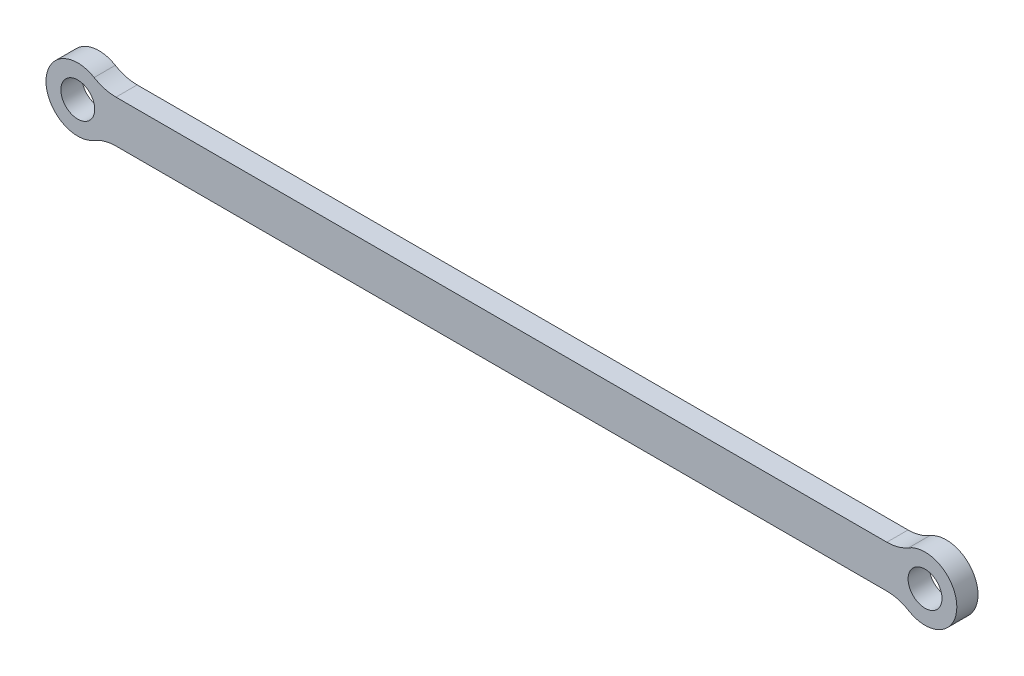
ISO-10303-21;
HEADER;
FILE_DESCRIPTION(('STEP AP214'),'2;1');
FILE_NAME('part.step','',(''),(''),'','','');
FILE_SCHEMA(('AUTOMOTIVE_DESIGN { 1 0 10303 214 1 1 1 1 }'));
ENDSEC;
DATA;
#1=APPLICATION_CONTEXT('core data for automotive mechanical design processes');
#2=APPLICATION_PROTOCOL_DEFINITION('international standard','automotive_design',2000,#1);
#3=PRODUCT_CONTEXT('',#1,'mechanical');
#4=PRODUCT('Part','Part','',(#3));
#5=PRODUCT_RELATED_PRODUCT_CATEGORY('part','',(#4));
#6=PRODUCT_DEFINITION_FORMATION('','',#4);
#7=PRODUCT_DEFINITION_CONTEXT('part definition',#1,'design');
#8=PRODUCT_DEFINITION('design','',#6,#7);
#9=PRODUCT_DEFINITION_SHAPE('','',#8);
#10=(LENGTH_UNIT() NAMED_UNIT(*) SI_UNIT(.MILLI.,.METRE.));
#11=(NAMED_UNIT(*) PLANE_ANGLE_UNIT() SI_UNIT($,.RADIAN.));
#12=(NAMED_UNIT(*) SI_UNIT($,.STERADIAN.) SOLID_ANGLE_UNIT());
#13=UNCERTAINTY_MEASURE_WITH_UNIT(LENGTH_MEASURE(1.E-05),#10,'distance_accuracy_value','');
#14=(GEOMETRIC_REPRESENTATION_CONTEXT(3) GLOBAL_UNCERTAINTY_ASSIGNED_CONTEXT((#13)) GLOBAL_UNIT_ASSIGNED_CONTEXT((#10,
#11,#12)) REPRESENTATION_CONTEXT('',''));
#15=CARTESIAN_POINT('',(0.,0.,0.));
#16=DIRECTION('',(0.,0.,1.));
#17=DIRECTION('',(1.,0.,0.));
#18=AXIS2_PLACEMENT_3D('',#15,#16,#17);
#19=CARTESIAN_POINT('',(-83.1438532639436,357.100052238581,5.));
#20=DIRECTION('',(0.,0.,1.));
#21=DIRECTION('',(1.,0.,0.));
#22=AXIS2_PLACEMENT_3D('',#19,#20,#21);
#23=PLANE('',#22);
#24=CARTESIAN_POINT('',(107.842268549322,342.100052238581,5.));
#25=DIRECTION('',(0.,0.,1.));
#26=DIRECTION('',(1.,0.,0.));
#27=AXIS2_PLACEMENT_3D('',#24,#25,#26);
#28=CIRCLE('',#27,4.00000000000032);
#29=CARTESIAN_POINT('',(111.842268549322,342.100052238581,5.));
#30=VERTEX_POINT('',#29);
#31=EDGE_CURVE('E138',#30,#30,#28,.T.);
#32=ORIENTED_EDGE('',*,*,#31,.F.);
#33=EDGE_LOOP('',(#32));
#34=FACE_BOUND('',#33,.T.);
#35=CARTESIAN_POINT('',(-83.1438532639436,357.100052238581,5.));
#36=DIRECTION('',(0.,0.,-1.));
#37=DIRECTION('',(1.,0.,0.));
#38=AXIS2_PLACEMENT_3D('',#35,#36,#37);
#39=CIRCLE('',#38,10.);
#40=CARTESIAN_POINT('',(-83.1438532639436,347.100052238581,5.));
#41=VERTEX_POINT('',#40);
#42=CARTESIAN_POINT('',(-88.2946408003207,348.528623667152,5.));
#43=VERTEX_POINT('',#42);
#44=EDGE_CURVE('E149',#41,#43,#39,.T.);
#45=ORIENTED_EDGE('',*,*,#44,.T.);
#46=CARTESIAN_POINT('',(-92.1577314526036,342.100052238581,5.));
#47=DIRECTION('',(0.,0.,1.));
#48=DIRECTION('',(1.,0.,0.));
#49=AXIS2_PLACEMENT_3D('',#46,#47,#48);
#50=CIRCLE('',#49,7.50000000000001);
#51=CARTESIAN_POINT('',(-88.2946408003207,335.67148081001,5.));
#52=VERTEX_POINT('',#51);
#53=EDGE_CURVE('E97',#43,#52,#50,.T.);
#54=ORIENTED_EDGE('',*,*,#53,.T.);
#55=CARTESIAN_POINT('',(-83.1438532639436,327.100052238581,5.));
#56=DIRECTION('',(0.,0.,-1.));
#57=DIRECTION('',(-1.,0.,0.));
#58=AXIS2_PLACEMENT_3D('',#55,#56,#57);
#59=CIRCLE('',#58,10.);
#60=CARTESIAN_POINT('',(-83.1438532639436,337.100052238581,5.));
#61=VERTEX_POINT('',#60);
#62=EDGE_CURVE('E164',#52,#61,#59,.T.);
#63=ORIENTED_EDGE('',*,*,#62,.T.);
#64=DIRECTION('',(1.,0.,0.));
#65=VECTOR('',#64,1.);
#66=CARTESIAN_POINT('',(-83.1438532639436,337.100052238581,5.));
#67=LINE('',#66,#65);
#68=CARTESIAN_POINT('',(98.8283903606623,337.100052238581,5.));
#69=VERTEX_POINT('',#68);
#70=EDGE_CURVE('E177',#61,#69,#67,.T.);
#71=ORIENTED_EDGE('',*,*,#70,.T.);
#72=CARTESIAN_POINT('',(98.8283903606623,327.100052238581,5.));
#73=DIRECTION('',(0.,0.,-1.));
#74=DIRECTION('',(-1.,0.,0.));
#75=AXIS2_PLACEMENT_3D('',#72,#73,#74);
#76=CIRCLE('',#75,10.);
#77=CARTESIAN_POINT('',(103.97917789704,335.67148081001,5.));
#78=VERTEX_POINT('',#77);
#79=EDGE_CURVE('E116',#69,#78,#76,.T.);
#80=ORIENTED_EDGE('',*,*,#79,.T.);
#81=CARTESIAN_POINT('',(107.842268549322,342.100052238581,5.));
#82=DIRECTION('',(0.,0.,1.));
#83=DIRECTION('',(1.,0.,0.));
#84=AXIS2_PLACEMENT_3D('',#81,#82,#83);
#85=CIRCLE('',#84,7.49999999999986);
#86=CARTESIAN_POINT('',(103.97917789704,348.528623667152,5.));
#87=VERTEX_POINT('',#86);
#88=EDGE_CURVE('E110',#78,#87,#85,.T.);
#89=ORIENTED_EDGE('',*,*,#88,.T.);
#90=CARTESIAN_POINT('',(98.8283903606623,357.100052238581,5.));
#91=DIRECTION('',(0.,0.,-1.));
#92=DIRECTION('',(1.,0.,0.));
#93=AXIS2_PLACEMENT_3D('',#90,#91,#92);
#94=CIRCLE('',#93,10.);
#95=CARTESIAN_POINT('',(98.8283903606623,347.100052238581,5.));
#96=VERTEX_POINT('',#95);
#97=EDGE_CURVE('E114',#87,#96,#94,.T.);
#98=ORIENTED_EDGE('',*,*,#97,.T.);
#99=DIRECTION('',(-1.,0.,0.));
#100=VECTOR('',#99,1.);
#101=CARTESIAN_POINT('',(-83.1438532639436,347.100052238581,5.));
#102=LINE('',#101,#100);
#103=EDGE_CURVE('E54',#96,#41,#102,.T.);
#104=ORIENTED_EDGE('',*,*,#103,.T.);
#105=EDGE_LOOP('',(#45,#54,#63,#71,#80,#89,#98,#104));
#106=FACE_BOUND('',#105,.T.);
#107=CARTESIAN_POINT('',(-92.1577314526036,342.100052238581,5.));
#108=DIRECTION('',(0.,0.,1.));
#109=DIRECTION('',(1.,0.,0.));
#110=AXIS2_PLACEMENT_3D('',#107,#108,#109);
#111=CIRCLE('',#110,4.00000000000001);
#112=CARTESIAN_POINT('',(-88.1577314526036,342.100052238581,5.));
#113=VERTEX_POINT('',#112);
#114=EDGE_CURVE('E186',#113,#113,#111,.T.);
#115=ORIENTED_EDGE('',*,*,#114,.F.);
#116=EDGE_LOOP('',(#115));
#117=FACE_BOUND('',#116,.T.);
#118=ADVANCED_FACE('F37',(#34,#106,#117),#23,.T.);
#119=CARTESIAN_POINT('',(-83.1438532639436,357.100052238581,0.));
#120=DIRECTION('',(0.,0.,1.));
#121=DIRECTION('',(1.,0.,0.));
#122=AXIS2_PLACEMENT_3D('',#119,#120,#121);
#123=PLANE('',#122);
#124=CARTESIAN_POINT('',(-83.1438532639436,357.100052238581,0.));
#125=DIRECTION('',(0.,0.,-1.));
#126=DIRECTION('',(1.,0.,0.));
#127=AXIS2_PLACEMENT_3D('',#124,#125,#126);
#128=CIRCLE('',#127,10.);
#129=CARTESIAN_POINT('',(-83.1438532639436,347.100052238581,0.));
#130=VERTEX_POINT('',#129);
#131=CARTESIAN_POINT('',(-88.2946408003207,348.528623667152,0.));
#132=VERTEX_POINT('',#131);
#133=EDGE_CURVE('E134',#130,#132,#128,.T.);
#134=ORIENTED_EDGE('',*,*,#133,.F.);
#135=DIRECTION('',(-1.,0.,0.));
#136=VECTOR('',#135,1.);
#137=CARTESIAN_POINT('',(-83.1438532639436,347.100052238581,0.));
#138=LINE('',#137,#136);
#139=CARTESIAN_POINT('',(98.8283903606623,347.100052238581,0.));
#140=VERTEX_POINT('',#139);
#141=EDGE_CURVE('E89',#140,#130,#138,.T.);
#142=ORIENTED_EDGE('',*,*,#141,.F.);
#143=CARTESIAN_POINT('',(98.8283903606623,357.100052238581,0.));
#144=DIRECTION('',(0.,0.,-1.));
#145=DIRECTION('',(1.,0.,0.));
#146=AXIS2_PLACEMENT_3D('',#143,#144,#145);
#147=CIRCLE('',#146,10.);
#148=CARTESIAN_POINT('',(103.97917789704,348.528623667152,0.));
#149=VERTEX_POINT('',#148);
#150=EDGE_CURVE('E83',#149,#140,#147,.T.);
#151=ORIENTED_EDGE('',*,*,#150,.F.);
#152=CARTESIAN_POINT('',(107.842268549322,342.100052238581,0.));
#153=DIRECTION('',(0.,0.,1.));
#154=DIRECTION('',(1.,0.,0.));
#155=AXIS2_PLACEMENT_3D('',#152,#153,#154);
#156=CIRCLE('',#155,7.49999999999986);
#157=CARTESIAN_POINT('',(103.97917789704,335.67148081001,0.));
#158=VERTEX_POINT('',#157);
#159=EDGE_CURVE('E124',#158,#149,#156,.T.);
#160=ORIENTED_EDGE('',*,*,#159,.F.);
#161=CARTESIAN_POINT('',(98.8283903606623,327.100052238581,0.));
#162=DIRECTION('',(0.,0.,-1.));
#163=DIRECTION('',(-1.,0.,0.));
#164=AXIS2_PLACEMENT_3D('',#161,#162,#163);
#165=CIRCLE('',#164,10.);
#166=CARTESIAN_POINT('',(98.8283903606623,337.100052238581,0.));
#167=VERTEX_POINT('',#166);
#168=EDGE_CURVE('E144',#167,#158,#165,.T.);
#169=ORIENTED_EDGE('',*,*,#168,.F.);
#170=DIRECTION('',(1.,0.,0.));
#171=VECTOR('',#170,1.);
#172=CARTESIAN_POINT('',(-83.1438532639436,337.100052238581,0.));
#173=LINE('',#172,#171);
#174=CARTESIAN_POINT('',(-83.1438532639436,337.100052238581,0.));
#175=VERTEX_POINT('',#174);
#176=EDGE_CURVE('E142',#175,#167,#173,.T.);
#177=ORIENTED_EDGE('',*,*,#176,.F.);
#178=CARTESIAN_POINT('',(-83.1438532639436,327.100052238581,0.));
#179=DIRECTION('',(0.,0.,-1.));
#180=DIRECTION('',(-1.,0.,0.));
#181=AXIS2_PLACEMENT_3D('',#178,#179,#180);
#182=CIRCLE('',#181,10.);
#183=CARTESIAN_POINT('',(-88.2946408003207,335.67148081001,0.));
#184=VERTEX_POINT('',#183);
#185=EDGE_CURVE('E140',#184,#175,#182,.T.);
#186=ORIENTED_EDGE('',*,*,#185,.F.);
#187=CARTESIAN_POINT('',(-92.1577314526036,342.100052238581,0.));
#188=DIRECTION('',(0.,0.,1.));
#189=DIRECTION('',(1.,0.,0.));
#190=AXIS2_PLACEMENT_3D('',#187,#188,#189);
#191=CIRCLE('',#190,7.50000000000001);
#192=EDGE_CURVE('E137',#132,#184,#191,.T.);
#193=ORIENTED_EDGE('',*,*,#192,.F.);
#194=EDGE_LOOP('',(#134,#142,#151,#160,#169,#177,#186,#193));
#195=FACE_BOUND('',#194,.T.);
#196=CARTESIAN_POINT('',(107.842268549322,342.100052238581,0.));
#197=DIRECTION('',(0.,0.,1.));
#198=DIRECTION('',(1.,0.,0.));
#199=AXIS2_PLACEMENT_3D('',#196,#197,#198);
#200=CIRCLE('',#199,4.00000000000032);
#201=CARTESIAN_POINT('',(111.842268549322,342.100052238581,0.));
#202=VERTEX_POINT('',#201);
#203=EDGE_CURVE('E183',#202,#202,#200,.T.);
#204=ORIENTED_EDGE('',*,*,#203,.T.);
#205=EDGE_LOOP('',(#204));
#206=FACE_BOUND('',#205,.T.);
#207=CARTESIAN_POINT('',(-92.1577314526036,342.100052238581,0.));
#208=DIRECTION('',(0.,0.,1.));
#209=DIRECTION('',(1.,0.,0.));
#210=AXIS2_PLACEMENT_3D('',#207,#208,#209);
#211=CIRCLE('',#210,4.00000000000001);
#212=CARTESIAN_POINT('',(-88.1577314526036,342.100052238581,0.));
#213=VERTEX_POINT('',#212);
#214=EDGE_CURVE('E189',#213,#213,#211,.T.);
#215=ORIENTED_EDGE('',*,*,#214,.T.);
#216=EDGE_LOOP('',(#215));
#217=FACE_BOUND('',#216,.T.);
#218=ADVANCED_FACE('F168',(#195,#206,#217),#123,.F.);
#219=CARTESIAN_POINT('',(-83.1438532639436,357.100052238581,5.));
#220=DIRECTION('',(0.,0.,-1.));
#221=DIRECTION('',(-1.,0.,0.));
#222=AXIS2_PLACEMENT_3D('',#219,#220,#221);
#223=CYLINDRICAL_SURFACE('',#222,10.);
#224=ORIENTED_EDGE('',*,*,#133,.T.);
#225=DIRECTION('',(0.,0.,-1.));
#226=VECTOR('',#225,1.);
#227=CARTESIAN_POINT('',(-88.2946408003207,348.528623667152,5.));
#228=LINE('',#227,#226);
#229=EDGE_CURVE('E11',#43,#132,#228,.T.);
#230=ORIENTED_EDGE('',*,*,#229,.F.);
#231=ORIENTED_EDGE('',*,*,#44,.F.);
#232=DIRECTION('',(0.,0.,-1.));
#233=VECTOR('',#232,1.);
#234=CARTESIAN_POINT('',(-83.1438532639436,347.100052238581,5.));
#235=LINE('',#234,#233);
#236=EDGE_CURVE('E130',#41,#130,#235,.T.);
#237=ORIENTED_EDGE('',*,*,#236,.T.);
#238=EDGE_LOOP('',(#224,#230,#231,#237));
#239=FACE_BOUND('',#238,.T.);
#240=ADVANCED_FACE('F39',(#239),#223,.F.);
#241=CARTESIAN_POINT('',(-92.1577314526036,342.100052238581,5.));
#242=DIRECTION('',(0.,0.,-1.));
#243=DIRECTION('',(-1.,0.,0.));
#244=AXIS2_PLACEMENT_3D('',#241,#242,#243);
#245=CYLINDRICAL_SURFACE('',#244,7.50000000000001);
#246=ORIENTED_EDGE('',*,*,#192,.T.);
#247=DIRECTION('',(0.,0.,-1.));
#248=VECTOR('',#247,1.);
#249=CARTESIAN_POINT('',(-88.2946408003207,335.67148081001,5.));
#250=LINE('',#249,#248);
#251=EDGE_CURVE('E46',#52,#184,#250,.T.);
#252=ORIENTED_EDGE('',*,*,#251,.F.);
#253=ORIENTED_EDGE('',*,*,#53,.F.);
#254=ORIENTED_EDGE('',*,*,#229,.T.);
#255=EDGE_LOOP('',(#246,#252,#253,#254));
#256=FACE_BOUND('',#255,.T.);
#257=ADVANCED_FACE('F221',(#256),#245,.T.);
#258=CARTESIAN_POINT('',(-83.1438532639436,327.100052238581,5.));
#259=DIRECTION('',(0.,0.,-1.));
#260=DIRECTION('',(-1.,0.,0.));
#261=AXIS2_PLACEMENT_3D('',#258,#259,#260);
#262=CYLINDRICAL_SURFACE('',#261,10.);
#263=ORIENTED_EDGE('',*,*,#185,.T.);
#264=DIRECTION('',(0.,0.,-1.));
#265=VECTOR('',#264,1.);
#266=CARTESIAN_POINT('',(-83.1438532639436,337.100052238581,5.));
#267=LINE('',#266,#265);
#268=EDGE_CURVE('E156',#61,#175,#267,.T.);
#269=ORIENTED_EDGE('',*,*,#268,.F.);
#270=ORIENTED_EDGE('',*,*,#62,.F.);
#271=ORIENTED_EDGE('',*,*,#251,.T.);
#272=EDGE_LOOP('',(#263,#269,#270,#271));
#273=FACE_BOUND('',#272,.T.);
#274=ADVANCED_FACE('F162',(#273),#262,.F.);
#275=CARTESIAN_POINT('',(-83.1438532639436,337.100052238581,5.));
#276=DIRECTION('',(0.,1.,0.));
#277=DIRECTION('',(-1.,0.,0.));
#278=AXIS2_PLACEMENT_3D('',#275,#276,#277);
#279=PLANE('',#278);
#280=ORIENTED_EDGE('',*,*,#176,.T.);
#281=DIRECTION('',(0.,0.,-1.));
#282=VECTOR('',#281,1.);
#283=CARTESIAN_POINT('',(98.8283903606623,337.100052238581,5.));
#284=LINE('',#283,#282);
#285=EDGE_CURVE('E153',#69,#167,#284,.T.);
#286=ORIENTED_EDGE('',*,*,#285,.F.);
#287=ORIENTED_EDGE('',*,*,#70,.F.);
#288=ORIENTED_EDGE('',*,*,#268,.T.);
#289=EDGE_LOOP('',(#280,#286,#287,#288));
#290=FACE_BOUND('',#289,.T.);
#291=ADVANCED_FACE('F173',(#290),#279,.F.);
#292=CARTESIAN_POINT('',(98.8283903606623,327.100052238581,5.));
#293=DIRECTION('',(0.,0.,-1.));
#294=DIRECTION('',(-1.,0.,0.));
#295=AXIS2_PLACEMENT_3D('',#292,#293,#294);
#296=CYLINDRICAL_SURFACE('',#295,10.);
#297=ORIENTED_EDGE('',*,*,#168,.T.);
#298=DIRECTION('',(0.,0.,-1.));
#299=VECTOR('',#298,1.);
#300=CARTESIAN_POINT('',(103.97917789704,335.67148081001,5.));
#301=LINE('',#300,#299);
#302=EDGE_CURVE('E125',#78,#158,#301,.T.);
#303=ORIENTED_EDGE('',*,*,#302,.F.);
#304=ORIENTED_EDGE('',*,*,#79,.F.);
#305=ORIENTED_EDGE('',*,*,#285,.T.);
#306=EDGE_LOOP('',(#297,#303,#304,#305));
#307=FACE_BOUND('',#306,.T.);
#308=ADVANCED_FACE('F176',(#307),#296,.F.);
#309=CARTESIAN_POINT('',(107.842268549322,342.100052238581,5.));
#310=DIRECTION('',(0.,0.,-1.));
#311=DIRECTION('',(-1.,0.,0.));
#312=AXIS2_PLACEMENT_3D('',#309,#310,#311);
#313=CYLINDRICAL_SURFACE('',#312,7.49999999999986);
#314=ORIENTED_EDGE('',*,*,#159,.T.);
#315=DIRECTION('',(0.,0.,-1.));
#316=VECTOR('',#315,1.);
#317=CARTESIAN_POINT('',(103.97917789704,348.528623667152,5.));
#318=LINE('',#317,#316);
#319=EDGE_CURVE('E121',#87,#149,#318,.T.);
#320=ORIENTED_EDGE('',*,*,#319,.F.);
#321=ORIENTED_EDGE('',*,*,#88,.F.);
#322=ORIENTED_EDGE('',*,*,#302,.T.);
#323=EDGE_LOOP('',(#314,#320,#321,#322));
#324=FACE_BOUND('',#323,.T.);
#325=ADVANCED_FACE('F122',(#324),#313,.T.);
#326=CARTESIAN_POINT('',(98.8283903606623,357.100052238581,5.));
#327=DIRECTION('',(0.,0.,-1.));
#328=DIRECTION('',(-1.,0.,0.));
#329=AXIS2_PLACEMENT_3D('',#326,#327,#328);
#330=CYLINDRICAL_SURFACE('',#329,10.);
#331=ORIENTED_EDGE('',*,*,#150,.T.);
#332=DIRECTION('',(0.,0.,-1.));
#333=VECTOR('',#332,1.);
#334=CARTESIAN_POINT('',(98.8283903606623,347.100052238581,5.));
#335=LINE('',#334,#333);
#336=EDGE_CURVE('E126',#96,#140,#335,.T.);
#337=ORIENTED_EDGE('',*,*,#336,.F.);
#338=ORIENTED_EDGE('',*,*,#97,.F.);
#339=ORIENTED_EDGE('',*,*,#319,.T.);
#340=EDGE_LOOP('',(#331,#337,#338,#339));
#341=FACE_BOUND('',#340,.T.);
#342=ADVANCED_FACE('F128',(#341),#330,.F.);
#343=CARTESIAN_POINT('',(-83.1438532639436,347.100052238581,5.));
#344=DIRECTION('',(0.,-1.,0.));
#345=DIRECTION('',(1.,0.,0.));
#346=AXIS2_PLACEMENT_3D('',#343,#344,#345);
#347=PLANE('',#346);
#348=ORIENTED_EDGE('',*,*,#141,.T.);
#349=ORIENTED_EDGE('',*,*,#236,.F.);
#350=ORIENTED_EDGE('',*,*,#103,.F.);
#351=ORIENTED_EDGE('',*,*,#336,.T.);
#352=EDGE_LOOP('',(#348,#349,#350,#351));
#353=FACE_BOUND('',#352,.T.);
#354=ADVANCED_FACE('F209',(#353),#347,.F.);
#355=CARTESIAN_POINT('',(107.842268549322,342.100052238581,5.));
#356=DIRECTION('',(0.,0.,-1.));
#357=DIRECTION('',(-1.,0.,0.));
#358=AXIS2_PLACEMENT_3D('',#355,#356,#357);
#359=CYLINDRICAL_SURFACE('',#358,4.00000000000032);
#360=ORIENTED_EDGE('',*,*,#31,.T.);
#361=EDGE_LOOP('',(#360));
#362=FACE_BOUND('',#361,.T.);
#363=ORIENTED_EDGE('',*,*,#203,.F.);
#364=EDGE_LOOP('',(#363));
#365=FACE_BOUND('',#364,.T.);
#366=ADVANCED_FACE('F206',(#362,#365),#359,.F.);
#367=CARTESIAN_POINT('',(-92.1577314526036,342.100052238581,5.));
#368=DIRECTION('',(0.,0.,-1.));
#369=DIRECTION('',(-1.,0.,0.));
#370=AXIS2_PLACEMENT_3D('',#367,#368,#369);
#371=CYLINDRICAL_SURFACE('',#370,4.00000000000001);
#372=ORIENTED_EDGE('',*,*,#114,.T.);
#373=EDGE_LOOP('',(#372));
#374=FACE_BOUND('',#373,.T.);
#375=ORIENTED_EDGE('',*,*,#214,.F.);
#376=EDGE_LOOP('',(#375));
#377=FACE_BOUND('',#376,.T.);
#378=ADVANCED_FACE('F195',(#374,#377),#371,.F.);
#379=CLOSED_SHELL('',(#118,#218,#240,#257,#274,#291,#308,#325,#342,#354,#366,#378));
#380=MANIFOLD_SOLID_BREP('B2',#379);
#381=ADVANCED_BREP_SHAPE_REPRESENTATION('',(#18,#380),#14);
#382=SHAPE_DEFINITION_REPRESENTATION(#9,#381);
ENDSEC;
END-ISO-10303-21;
